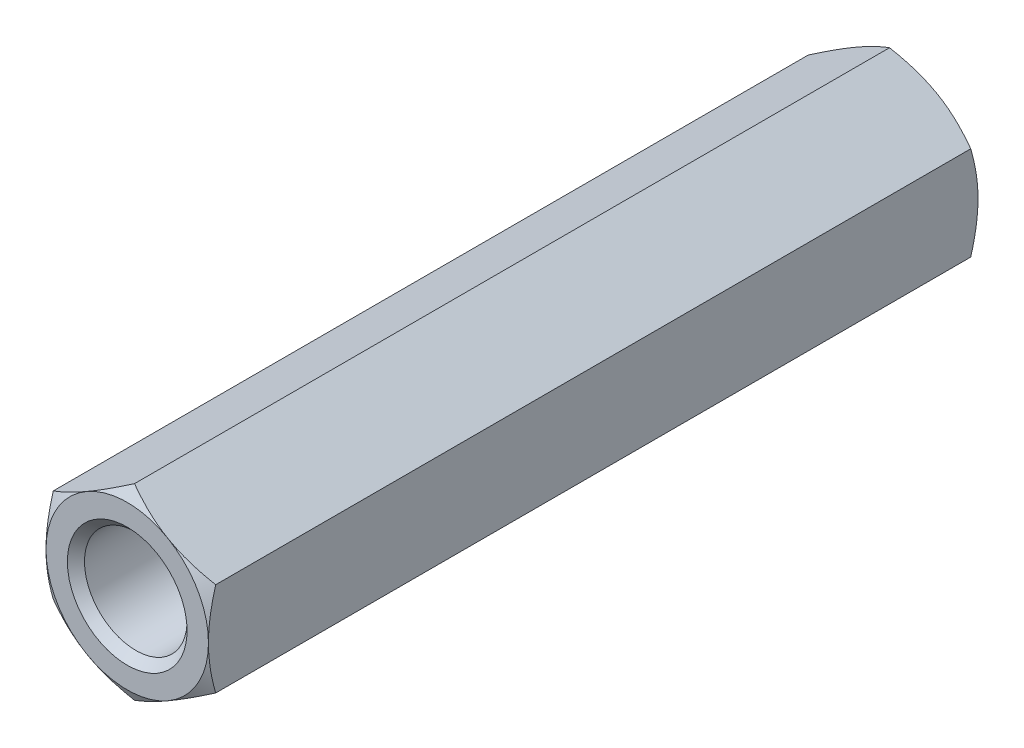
ISO-10303-21;
HEADER;
FILE_DESCRIPTION(('STEP AP214'),'2;1');
FILE_NAME('part.step','',(''),(''),'','','');
FILE_SCHEMA(('AUTOMOTIVE_DESIGN { 1 0 10303 214 1 1 1 1 }'));
ENDSEC;
DATA;
#1=APPLICATION_CONTEXT('core data for automotive mechanical design processes');
#2=APPLICATION_PROTOCOL_DEFINITION('international standard','automotive_design',2000,#1);
#3=PRODUCT_CONTEXT('',#1,'mechanical');
#4=PRODUCT('Part','Part','',(#3));
#5=PRODUCT_RELATED_PRODUCT_CATEGORY('part','',(#4));
#6=PRODUCT_DEFINITION_FORMATION('','',#4);
#7=PRODUCT_DEFINITION_CONTEXT('part definition',#1,'design');
#8=PRODUCT_DEFINITION('design','',#6,#7);
#9=PRODUCT_DEFINITION_SHAPE('','',#8);
#10=(LENGTH_UNIT() NAMED_UNIT(*) SI_UNIT(.MILLI.,.METRE.));
#11=(NAMED_UNIT(*) PLANE_ANGLE_UNIT() SI_UNIT($,.RADIAN.));
#12=(NAMED_UNIT(*) SI_UNIT($,.STERADIAN.) SOLID_ANGLE_UNIT());
#13=UNCERTAINTY_MEASURE_WITH_UNIT(LENGTH_MEASURE(1.E-05),#10,'distance_accuracy_value','');
#14=(GEOMETRIC_REPRESENTATION_CONTEXT(3) GLOBAL_UNCERTAINTY_ASSIGNED_CONTEXT((#13)) GLOBAL_UNIT_ASSIGNED_CONTEXT((#10,
#11,#12)) REPRESENTATION_CONTEXT('',''));
#15=CARTESIAN_POINT('',(0.,0.,0.));
#16=DIRECTION('',(0.,0.,1.));
#17=DIRECTION('',(1.,0.,0.));
#18=AXIS2_PLACEMENT_3D('',#15,#16,#17);
#19=CARTESIAN_POINT('',(9.5,5.48482755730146,90.));
#20=DIRECTION('',(-0.5,-0.866025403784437,0.));
#21=DIRECTION('',(-0.866025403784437,0.5,0.));
#22=AXIS2_PLACEMENT_3D('',#19,#20,#21);
#23=PLANE('',#22);
#24=CARTESIAN_POINT('',(-0.000200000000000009,10.9697705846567,0.848572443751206));
#25=CARTESIAN_POINT('',(0.208630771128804,10.8492020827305,0.778973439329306));
#26=CARTESIAN_POINT('',(0.418240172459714,10.7281840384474,0.712533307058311));
#27=CARTESIAN_POINT('',(0.839139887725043,10.4851774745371,0.586847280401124));
#28=CARTESIAN_POINT('',(1.05043073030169,10.3631886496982,0.52760375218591));
#29=CARTESIAN_POINT('',(1.68770779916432,9.99525656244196,0.361814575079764));
#30=CARTESIAN_POINT('',(2.11620976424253,9.74786083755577,0.267514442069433));
#31=CARTESIAN_POINT('',(2.75744333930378,9.37764446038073,0.156938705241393));
#32=CARTESIAN_POINT('',(2.96825921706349,9.25592985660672,0.125439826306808));
#33=CARTESIAN_POINT('',(3.39086703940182,9.01193711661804,0.072618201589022));
#34=CARTESIAN_POINT('',(3.60265900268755,8.88965896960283,0.0512956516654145));
#35=CARTESIAN_POINT('',(4.0265962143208,8.64489870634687,0.0193730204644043));
#36=CARTESIAN_POINT('',(4.23874074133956,8.52241700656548,0.00876019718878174));
#37=CARTESIAN_POINT('',(4.66322575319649,8.27734047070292,-0.00151746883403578));
#38=CARTESIAN_POINT('',(4.87556623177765,8.15474563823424,-0.00118264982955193));
#39=CARTESIAN_POINT('',(5.27254199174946,7.92555157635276,0.00967336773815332));
#40=CARTESIAN_POINT('',(5.45720529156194,7.81893617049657,0.018870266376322));
#41=CARTESIAN_POINT('',(5.82610000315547,7.60595470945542,0.045365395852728));
#42=CARTESIAN_POINT('',(6.01033138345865,7.4995886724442,0.0626641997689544));
#43=CARTESIAN_POINT('',(6.56231167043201,7.18090270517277,0.126304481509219));
#44=CARTESIAN_POINT('',(6.92908353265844,6.96914687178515,0.184381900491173));
#45=CARTESIAN_POINT('',(7.66651782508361,6.54338898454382,0.329576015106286));
#46=CARTESIAN_POINT('',(8.03708614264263,6.32944126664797,0.417308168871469));
#47=CARTESIAN_POINT('',(8.77269671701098,5.90473630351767,0.616423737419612));
#48=CARTESIAN_POINT('',(9.137748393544,5.6939736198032,0.727760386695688));
#49=CARTESIAN_POINT('',(9.5002,5.48471208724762,0.848572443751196));
#50=B_SPLINE_CURVE_WITH_KNOTS('',3,(#24,#25,#26,#27,#28,#29,#30,#31,#32,#33,#34,#35,#36,#37,#38,
#39,#40,#41,#42,#43,#44,#45,#46,#47,#48,#49),.UNSPECIFIED.,.F.,.F.,(4,2,2,2,2,2,2,2,2,2,2,2,4),
(0.,0.752880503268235,1.50600787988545,3.0154687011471,3.75167336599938,4.48789219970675,
5.22323407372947,5.95855322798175,6.59868084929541,7.23885375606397,8.52010929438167,
9.82978009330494,11.1368800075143),.UNSPECIFIED.);
#51=CARTESIAN_POINT('',(0.,10.9696551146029,0.848505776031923));
#52=VERTEX_POINT('',#51);
#53=CARTESIAN_POINT('',(4.75,8.22724133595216,0.));
#54=VERTEX_POINT('',#53);
#55=EDGE_CURVE('E330',#52,#54,#50,.T.);
#56=ORIENTED_EDGE('',*,*,#55,.F.);
#57=DIRECTION('',(0.,0.,-1.));
#58=VECTOR('',#57,1.);
#59=CARTESIAN_POINT('',(0.,10.9696551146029,90.));
#60=LINE('',#59,#58);
#61=CARTESIAN_POINT('',(0.,10.9696551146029,89.1514942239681));
#62=VERTEX_POINT('',#61);
#63=EDGE_CURVE('E239',#62,#52,#60,.T.);
#64=ORIENTED_EDGE('',*,*,#63,.F.);
#65=CARTESIAN_POINT('',(9.5002,5.48471208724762,89.1514275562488));
#66=CARTESIAN_POINT('',(9.29136922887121,5.60528058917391,89.2210265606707));
#67=CARTESIAN_POINT('',(9.0817598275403,5.72629863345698,89.2874666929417));
#68=CARTESIAN_POINT('',(8.66086011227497,5.96930519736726,89.4131527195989));
#69=CARTESIAN_POINT('',(8.44956926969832,6.09129402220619,89.4723962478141));
#70=CARTESIAN_POINT('',(7.81229220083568,6.45922610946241,89.6381854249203));
#71=CARTESIAN_POINT('',(7.38379023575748,6.7066218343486,89.7324855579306));
#72=CARTESIAN_POINT('',(6.74255666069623,7.07683821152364,89.8430612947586));
#73=CARTESIAN_POINT('',(6.53174078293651,7.19855281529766,89.8745601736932));
#74=CARTESIAN_POINT('',(6.10913296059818,7.44254555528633,89.927381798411));
#75=CARTESIAN_POINT('',(5.89734099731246,7.56482370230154,89.9487043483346));
#76=CARTESIAN_POINT('',(5.47340378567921,7.8095839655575,89.9806269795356));
#77=CARTESIAN_POINT('',(5.26125925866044,7.93206566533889,89.9912398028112));
#78=CARTESIAN_POINT('',(4.83677424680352,8.17714220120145,90.0015174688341));
#79=CARTESIAN_POINT('',(4.62443376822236,8.29973703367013,90.0011826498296));
#80=CARTESIAN_POINT('',(4.22745800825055,8.52893109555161,89.9903266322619));
#81=CARTESIAN_POINT('',(4.04279470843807,8.6355465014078,89.9811297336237));
#82=CARTESIAN_POINT('',(3.67389999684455,8.84852796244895,89.9546346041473));
#83=CARTESIAN_POINT('',(3.48966861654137,8.95489399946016,89.9373358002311));
#84=CARTESIAN_POINT('',(2.93768832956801,9.2735799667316,89.8736955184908));
#85=CARTESIAN_POINT('',(2.57091646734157,9.48533580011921,89.8156180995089));
#86=CARTESIAN_POINT('',(1.83348217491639,9.91109368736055,89.6704239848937));
#87=CARTESIAN_POINT('',(1.46291385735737,10.1250414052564,89.5826918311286));
#88=CARTESIAN_POINT('',(0.727303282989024,10.5497463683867,89.3835762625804));
#89=CARTESIAN_POINT('',(0.362251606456,10.7605090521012,89.2722396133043));
#90=CARTESIAN_POINT('',(-0.000199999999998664,10.9697705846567,89.1514275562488));
#91=B_SPLINE_CURVE_WITH_KNOTS('',3,(#65,#66,#67,#68,#69,#70,#71,#72,#73,#74,#75,#76,#77,#78,#79,
#80,#81,#82,#83,#84,#85,#86,#87,#88,#89,#90),.UNSPECIFIED.,.F.,.F.,(4,2,2,2,2,2,2,2,2,2,2,2,4),
(0.,0.752880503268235,1.50600787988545,3.01546870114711,3.75167336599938,4.48789219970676,
5.22323407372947,5.95855322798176,6.59868084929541,7.23885375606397,8.52010929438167,
9.82978009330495,11.1368800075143),.UNSPECIFIED.);
#92=CARTESIAN_POINT('',(4.75,8.22724133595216,90.));
#93=VERTEX_POINT('',#92);
#94=EDGE_CURVE('E225',#93,#62,#91,.T.);
#95=ORIENTED_EDGE('',*,*,#94,.F.);
#96=CARTESIAN_POINT('',(9.5,5.48482755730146,89.1514942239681));
#97=VERTEX_POINT('',#96);
#98=EDGE_CURVE('E301',#97,#93,#91,.T.);
#99=ORIENTED_EDGE('',*,*,#98,.F.);
#100=DIRECTION('',(0.,0.,-1.));
#101=VECTOR('',#100,1.);
#102=CARTESIAN_POINT('',(9.5,5.48482755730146,90.));
#103=LINE('',#102,#101);
#104=CARTESIAN_POINT('',(9.5,5.48482755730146,0.848505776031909));
#105=VERTEX_POINT('',#104);
#106=EDGE_CURVE('E227',#97,#105,#103,.T.);
#107=ORIENTED_EDGE('',*,*,#106,.T.);
#108=EDGE_CURVE('E37',#54,#105,#50,.T.);
#109=ORIENTED_EDGE('',*,*,#108,.F.);
#110=EDGE_LOOP('',(#56,#64,#95,#99,#107,#109));
#111=FACE_BOUND('',#110,.T.);
#112=ADVANCED_FACE('F14',(#111),#23,.F.);
#113=CARTESIAN_POINT('',(-9.5,5.48482755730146,90.));
#114=DIRECTION('',(-0.5,0.866025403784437,0.));
#115=DIRECTION('',(0.866025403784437,0.5,0.));
#116=AXIS2_PLACEMENT_3D('',#113,#114,#115);
#117=PLANE('',#116);
#118=ORIENTED_EDGE('',*,*,#63,.T.);
#119=CARTESIAN_POINT('',(0.000199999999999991,10.9697705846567,0.848572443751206));
#120=CARTESIAN_POINT('',(-0.208630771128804,10.8492020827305,0.778973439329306));
#121=CARTESIAN_POINT('',(-0.418240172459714,10.7281840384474,0.712533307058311));
#122=CARTESIAN_POINT('',(-0.839139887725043,10.4851774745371,0.586847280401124));
#123=CARTESIAN_POINT('',(-1.05043073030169,10.3631886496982,0.52760375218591));
#124=CARTESIAN_POINT('',(-1.68770779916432,9.99525656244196,0.361814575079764));
#125=CARTESIAN_POINT('',(-2.11620976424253,9.74786083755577,0.267514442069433));
#126=CARTESIAN_POINT('',(-2.75744333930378,9.37764446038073,0.156938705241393));
#127=CARTESIAN_POINT('',(-2.96825921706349,9.25592985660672,0.125439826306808));
#128=CARTESIAN_POINT('',(-3.39086703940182,9.01193711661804,0.072618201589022));
#129=CARTESIAN_POINT('',(-3.60265900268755,8.88965896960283,0.0512956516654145));
#130=CARTESIAN_POINT('',(-4.0265962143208,8.64489870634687,0.0193730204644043));
#131=CARTESIAN_POINT('',(-4.23874074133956,8.52241700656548,0.00876019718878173));
#132=CARTESIAN_POINT('',(-4.66322575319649,8.27734047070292,-0.00151746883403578));
#133=CARTESIAN_POINT('',(-4.87556623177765,8.15474563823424,-0.00118264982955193));
#134=CARTESIAN_POINT('',(-5.27254199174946,7.92555157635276,0.00967336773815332));
#135=CARTESIAN_POINT('',(-5.45720529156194,7.81893617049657,0.018870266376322));
#136=CARTESIAN_POINT('',(-5.82610000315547,7.60595470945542,0.045365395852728));
#137=CARTESIAN_POINT('',(-6.01033138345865,7.4995886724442,0.0626641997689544));
#138=CARTESIAN_POINT('',(-6.56231167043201,7.18090270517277,0.126304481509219));
#139=CARTESIAN_POINT('',(-6.92908353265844,6.96914687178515,0.184381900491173));
#140=CARTESIAN_POINT('',(-7.66651782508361,6.54338898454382,0.329576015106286));
#141=CARTESIAN_POINT('',(-8.03708614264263,6.32944126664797,0.417308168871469));
#142=CARTESIAN_POINT('',(-8.77269671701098,5.90473630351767,0.616423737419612));
#143=CARTESIAN_POINT('',(-9.137748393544,5.6939736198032,0.727760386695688));
#144=CARTESIAN_POINT('',(-9.5002,5.48471208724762,0.848572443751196));
#145=B_SPLINE_CURVE_WITH_KNOTS('',3,(#119,#120,#121,#122,#123,#124,#125,#126,#127,#128,#129,
#130,#131,#132,#133,#134,#135,#136,#137,#138,#139,#140,#141,#142,#143,#144),.UNSPECIFIED.,.F.,
.F.,(4,2,2,2,2,2,2,2,2,2,2,2,4),(0.,0.752880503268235,1.50600787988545,3.0154687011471,
3.75167336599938,4.48789219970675,5.22323407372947,5.95855322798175,6.59868084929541,
7.23885375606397,8.52010929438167,9.82978009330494,11.1368800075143),.UNSPECIFIED.);
#146=CARTESIAN_POINT('',(-4.75,8.22724133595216,0.));
#147=VERTEX_POINT('',#146);
#148=EDGE_CURVE('E184',#52,#147,#145,.T.);
#149=ORIENTED_EDGE('',*,*,#148,.T.);
#150=CARTESIAN_POINT('',(-9.5,5.48482755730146,0.848505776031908));
#151=VERTEX_POINT('',#150);
#152=EDGE_CURVE('E319',#147,#151,#145,.T.);
#153=ORIENTED_EDGE('',*,*,#152,.T.);
#154=DIRECTION('',(0.,0.,-1.));
#155=VECTOR('',#154,1.);
#156=CARTESIAN_POINT('',(-9.5,5.48482755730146,90.));
#157=LINE('',#156,#155);
#158=CARTESIAN_POINT('',(-9.5,5.48482755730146,89.1514942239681));
#159=VERTEX_POINT('',#158);
#160=EDGE_CURVE('E236',#159,#151,#157,.T.);
#161=ORIENTED_EDGE('',*,*,#160,.F.);
#162=CARTESIAN_POINT('',(-9.5002,5.48471208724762,89.1514275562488));
#163=CARTESIAN_POINT('',(-9.29136922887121,5.60528058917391,89.2210265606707));
#164=CARTESIAN_POINT('',(-9.0817598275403,5.72629863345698,89.2874666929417));
#165=CARTESIAN_POINT('',(-8.66086011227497,5.96930519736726,89.4131527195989));
#166=CARTESIAN_POINT('',(-8.44956926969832,6.09129402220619,89.4723962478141));
#167=CARTESIAN_POINT('',(-7.81229220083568,6.45922610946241,89.6381854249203));
#168=CARTESIAN_POINT('',(-7.38379023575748,6.7066218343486,89.7324855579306));
#169=CARTESIAN_POINT('',(-6.74255666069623,7.07683821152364,89.8430612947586));
#170=CARTESIAN_POINT('',(-6.53174078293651,7.19855281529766,89.8745601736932));
#171=CARTESIAN_POINT('',(-6.10913296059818,7.44254555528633,89.927381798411));
#172=CARTESIAN_POINT('',(-5.89734099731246,7.56482370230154,89.9487043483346));
#173=CARTESIAN_POINT('',(-5.47340378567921,7.8095839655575,89.9806269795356));
#174=CARTESIAN_POINT('',(-5.26125925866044,7.93206566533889,89.9912398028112));
#175=CARTESIAN_POINT('',(-4.83677424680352,8.17714220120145,90.0015174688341));
#176=CARTESIAN_POINT('',(-4.62443376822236,8.29973703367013,90.0011826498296));
#177=CARTESIAN_POINT('',(-4.22745800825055,8.52893109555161,89.9903266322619));
#178=CARTESIAN_POINT('',(-4.04279470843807,8.6355465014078,89.9811297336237));
#179=CARTESIAN_POINT('',(-3.67389999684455,8.84852796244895,89.9546346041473));
#180=CARTESIAN_POINT('',(-3.48966861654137,8.95489399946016,89.9373358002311));
#181=CARTESIAN_POINT('',(-2.93768832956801,9.2735799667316,89.8736955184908));
#182=CARTESIAN_POINT('',(-2.57091646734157,9.48533580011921,89.8156180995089));
#183=CARTESIAN_POINT('',(-1.83348217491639,9.91109368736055,89.6704239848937));
#184=CARTESIAN_POINT('',(-1.46291385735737,10.1250414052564,89.5826918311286));
#185=CARTESIAN_POINT('',(-0.727303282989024,10.5497463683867,89.3835762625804));
#186=CARTESIAN_POINT('',(-0.362251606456,10.7605090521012,89.2722396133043));
#187=CARTESIAN_POINT('',(0.000199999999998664,10.9697705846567,89.1514275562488));
#188=B_SPLINE_CURVE_WITH_KNOTS('',3,(#162,#163,#164,#165,#166,#167,#168,#169,#170,#171,#172,
#173,#174,#175,#176,#177,#178,#179,#180,#181,#182,#183,#184,#185,#186,#187),.UNSPECIFIED.,.F.,
.F.,(4,2,2,2,2,2,2,2,2,2,2,2,4),(0.,0.752880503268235,1.50600787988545,3.01546870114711,
3.75167336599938,4.48789219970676,5.22323407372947,5.95855322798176,6.59868084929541,
7.23885375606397,8.52010929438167,9.82978009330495,11.1368800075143),.UNSPECIFIED.);
#189=CARTESIAN_POINT('',(-4.75,8.22724133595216,90.));
#190=VERTEX_POINT('',#189);
#191=EDGE_CURVE('E218',#159,#190,#188,.T.);
#192=ORIENTED_EDGE('',*,*,#191,.T.);
#193=EDGE_CURVE('E226',#190,#62,#188,.T.);
#194=ORIENTED_EDGE('',*,*,#193,.T.);
#195=EDGE_LOOP('',(#118,#149,#153,#161,#192,#194));
#196=FACE_BOUND('',#195,.T.);
#197=ADVANCED_FACE('F197',(#196),#117,.T.);
#198=CARTESIAN_POINT('',(-9.5,5.48482755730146,90.));
#199=DIRECTION('',(1.,0.,0.));
#200=DIRECTION('',(0.,0.,-1.));
#201=AXIS2_PLACEMENT_3D('',#198,#199,#200);
#202=PLANE('',#201);
#203=CARTESIAN_POINT('',(-9.5,-14.7672659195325,4.65292601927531));
#204=CARTESIAN_POINT('',(-9.5,-14.5596695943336,4.55212888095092));
#205=CARTESIAN_POINT('',(-9.5,-14.351830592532,4.45183177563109));
#206=CARTESIAN_POINT('',(-9.5,-13.9356166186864,4.25235081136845));
#207=CARTESIAN_POINT('',(-9.5,-13.7272416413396,4.15316696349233));
#208=CARTESIAN_POINT('',(-9.5,-13.1011817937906,3.85742915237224));
#209=CARTESIAN_POINT('',(-9.5,-12.6826228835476,3.66271856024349));
#210=CARTESIAN_POINT('',(-9.5,-11.8404540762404,3.27834286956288));
#211=CARTESIAN_POINT('',(-9.5,-11.4168291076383,3.08871071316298));
#212=CARTESIAN_POINT('',(-9.5,-10.5662226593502,2.71715766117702));
#213=CARTESIAN_POINT('',(-9.5,-10.1392413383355,2.53523640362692));
#214=CARTESIAN_POINT('',(-9.5,-9.2673080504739,2.1753939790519));
#215=CARTESIAN_POINT('',(-9.5,-8.82222265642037,1.99779435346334));
#216=CARTESIAN_POINT('',(-9.5,-7.92685843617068,1.65595320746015));
#217=CARTESIAN_POINT('',(-9.5,-7.47657903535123,1.49171318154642));
#218=CARTESIAN_POINT('',(-9.5,-6.57093674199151,1.18087857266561));
#219=CARTESIAN_POINT('',(-9.5,-6.11558614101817,1.03424856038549));
#220=CARTESIAN_POINT('',(-9.5,-5.19836923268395,0.763314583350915));
#221=CARTESIAN_POINT('',(-9.5,-4.7365050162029,0.639003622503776));
#222=CARTESIAN_POINT('',(-9.5,-3.80850349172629,0.419324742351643));
#223=CARTESIAN_POINT('',(-9.5,-3.34240483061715,0.323797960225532));
#224=CARTESIAN_POINT('',(-9.5,-2.63898486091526,0.206211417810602));
#225=CARTESIAN_POINT('',(-9.5,-2.4037824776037,0.171298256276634));
#226=CARTESIAN_POINT('',(-9.5,-1.93219697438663,0.110723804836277));
#227=CARTESIAN_POINT('',(-9.5,-1.69581397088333,0.0850616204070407));
#228=CARTESIAN_POINT('',(-9.5,-1.22528668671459,0.0438240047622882));
#229=CARTESIAN_POINT('',(-9.5,-0.991153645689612,0.0281208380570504));
#230=CARTESIAN_POINT('',(-9.5,-0.522433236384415,0.00663142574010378));
#231=CARTESIAN_POINT('',(-9.5,-0.287845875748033,0.000845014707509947));
#232=CARTESIAN_POINT('',(-9.5,0.181363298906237,-0.000672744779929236));
#233=CARTESIAN_POINT('',(-9.5,0.415985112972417,0.0035959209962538));
#234=CARTESIAN_POINT('',(-9.5,0.884839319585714,0.0220834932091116));
#235=CARTESIAN_POINT('',(-9.5,1.11907169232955,0.0363028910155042));
#236=CARTESIAN_POINT('',(-9.5,1.68097627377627,0.0820480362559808));
#237=CARTESIAN_POINT('',(-9.5,2.00827686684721,0.118238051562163));
#238=CARTESIAN_POINT('',(-9.5,2.66045587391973,0.208080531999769));
#239=CARTESIAN_POINT('',(-9.5,2.98533395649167,0.261735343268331));
#240=CARTESIAN_POINT('',(-9.5,3.95596021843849,0.446052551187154));
#241=CARTESIAN_POINT('',(-9.5,4.59733913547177,0.600034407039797));
#242=CARTESIAN_POINT('',(-9.5,5.5563862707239,0.867143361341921));
#243=CARTESIAN_POINT('',(-9.5,5.87902704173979,0.963444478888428));
#244=CARTESIAN_POINT('',(-9.5,6.52117531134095,1.16607364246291));
#245=CARTESIAN_POINT('',(-9.5,6.84068278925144,1.27240175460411));
#246=CARTESIAN_POINT('',(-9.5,7.47666412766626,1.49337690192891));
#247=CARTESIAN_POINT('',(-9.5,7.79313894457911,1.60802120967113));
#248=CARTESIAN_POINT('',(-9.5,8.42346519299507,1.84427742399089));
#249=CARTESIAN_POINT('',(-9.5,8.73731665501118,1.96588924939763));
#250=CARTESIAN_POINT('',(-9.5,9.47687197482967,2.26039544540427));
#251=CARTESIAN_POINT('',(-9.5,9.90157382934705,2.43580132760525));
#252=CARTESIAN_POINT('',(-9.5,10.7473629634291,2.79514633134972));
#253=CARTESIAN_POINT('',(-9.5,11.1684500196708,2.97908597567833));
#254=CARTESIAN_POINT('',(-9.5,12.0076809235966,3.35379288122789));
#255=CARTESIAN_POINT('',(-9.5,12.4258240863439,3.5445616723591));
#256=CARTESIAN_POINT('',(-9.5,13.2595626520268,3.93155139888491));
#257=CARTESIAN_POINT('',(-9.5,13.6751581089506,4.12777221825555));
#258=CARTESIAN_POINT('',(-9.5,14.5046789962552,4.52486627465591));
#259=CARTESIAN_POINT('',(-9.5,14.9186020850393,4.72574439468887));
#260=CARTESIAN_POINT('',(-9.5,15.7446570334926,5.13114973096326));
#261=CARTESIAN_POINT('',(-9.5,16.1567888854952,5.33567696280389));
#262=CARTESIAN_POINT('',(-9.5,16.979482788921,5.7477289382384));
#263=CARTESIAN_POINT('',(-9.5,17.3900450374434,5.95525328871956));
#264=CARTESIAN_POINT('',(-9.5,18.2098797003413,6.37283570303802));
#265=CARTESIAN_POINT('',(-9.5,18.6191521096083,6.58289377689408));
#266=CARTESIAN_POINT('',(-9.5,19.7767832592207,7.18085913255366));
#267=CARTESIAN_POINT('',(-9.5,20.5238458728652,7.57127560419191));
#268=CARTESIAN_POINT('',(-9.5,22.0151817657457,8.35745134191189));
#269=CARTESIAN_POINT('',(-9.5,22.7594549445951,8.75321079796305));
#270=CARTESIAN_POINT('',(-9.5,24.2439478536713,9.54782405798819));
#271=CARTESIAN_POINT('',(-9.5,24.98417306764,9.94666762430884));
#272=CARTESIAN_POINT('',(-9.5,26.0931945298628,10.5473118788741));
#273=CARTESIAN_POINT('',(-9.5,26.4626389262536,10.7479176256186));
#274=CARTESIAN_POINT('',(-9.5,27.2011385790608,11.1498428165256));
#275=CARTESIAN_POINT('',(-9.5,27.5701938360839,11.351162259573));
#276=CARTESIAN_POINT('',(-9.5,27.9390765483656,11.5527974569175));
#277=B_SPLINE_CURVE_WITH_KNOTS('',3,(#203,#204,#205,#206,#207,#208,#209,#210,#211,#212,#213,
#214,#215,#216,#217,#218,#219,#220,#221,#222,#223,#224,#225,#226,#227,#228,#229,#230,#231,#232,
#233,#234,#235,#236,#237,#238,#239,#240,#241,#242,#243,#244,#245,#246,#247,#248,#249,#250,#251,
#252,#253,#254,#255,#256,#257,#258,#259,#260,#261,#262,#263,#264,#265,#266,#267,#268,#269,#270,
#271,#272,#273,#274,#275,#276),.UNSPECIFIED.,.F.,.F.,(4,2,2,2,2,2,2,2,2,2,2,2,2,2,2,2,2,2,2,2,2,
2,2,2,2,2,2,2,2,2,2,2,2,2,2,2,4),(0.,0.692318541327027,1.38464395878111,2.76949790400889,
4.16183368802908,5.55410404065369,6.99156897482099,8.42919449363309,9.86387742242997,
11.2981098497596,12.7242751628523,13.4374603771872,14.1505766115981,14.8543508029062,
15.5581132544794,16.2618767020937,16.9656749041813,17.9530035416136,18.9404648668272,
20.9164710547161,21.9265044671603,22.9365445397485,23.9462548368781,24.9559533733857,
26.3343232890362,27.7127777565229,29.0915429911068,30.4702789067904,31.8505323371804,
33.2307916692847,34.6108715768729,35.9909569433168,38.5197081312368,41.0485494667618,
43.5710546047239,44.8322385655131,46.0934205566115),.UNSPECIFIED.);
#278=CARTESIAN_POINT('',(-9.5,-5.48482755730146,0.848505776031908));
#279=VERTEX_POINT('',#278);
#280=CARTESIAN_POINT('',(-9.5,0.,0.));
#281=VERTEX_POINT('',#280);
#282=EDGE_CURVE('E178',#279,#281,#277,.T.);
#283=ORIENTED_EDGE('',*,*,#282,.F.);
#284=DIRECTION('',(0.,0.,-1.));
#285=VECTOR('',#284,1.);
#286=CARTESIAN_POINT('',(-9.5,-5.48482755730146,90.));
#287=LINE('',#286,#285);
#288=CARTESIAN_POINT('',(-9.5,-5.48482755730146,89.1514942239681));
#289=VERTEX_POINT('',#288);
#290=EDGE_CURVE('E233',#289,#279,#287,.T.);
#291=ORIENTED_EDGE('',*,*,#290,.F.);
#292=CARTESIAN_POINT('',(-9.5,-14.7672659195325,85.3470739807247));
#293=CARTESIAN_POINT('',(-9.5,-14.5596695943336,85.4478711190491));
#294=CARTESIAN_POINT('',(-9.5,-14.351830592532,85.5481682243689));
#295=CARTESIAN_POINT('',(-9.5,-13.9356166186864,85.7476491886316));
#296=CARTESIAN_POINT('',(-9.5,-13.7272416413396,85.8468330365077));
#297=CARTESIAN_POINT('',(-9.5,-13.1011817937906,86.1425708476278));
#298=CARTESIAN_POINT('',(-9.5,-12.6826228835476,86.3372814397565));
#299=CARTESIAN_POINT('',(-9.5,-11.8404540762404,86.7216571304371));
#300=CARTESIAN_POINT('',(-9.5,-11.4168291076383,86.9112892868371));
#301=CARTESIAN_POINT('',(-9.5,-10.5662226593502,87.282842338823));
#302=CARTESIAN_POINT('',(-9.5,-10.1392413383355,87.4647635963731));
#303=CARTESIAN_POINT('',(-9.5,-9.2673080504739,87.8246060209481));
#304=CARTESIAN_POINT('',(-9.5,-8.82222265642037,88.0022056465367));
#305=CARTESIAN_POINT('',(-9.5,-7.92685843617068,88.3440467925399));
#306=CARTESIAN_POINT('',(-9.5,-7.47657903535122,88.5082868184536));
#307=CARTESIAN_POINT('',(-9.5,-6.5709367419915,88.8191214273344));
#308=CARTESIAN_POINT('',(-9.5,-6.11558614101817,88.9657514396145));
#309=CARTESIAN_POINT('',(-9.5,-5.19836923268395,89.2366854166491));
#310=CARTESIAN_POINT('',(-9.5,-4.7365050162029,89.3609963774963));
#311=CARTESIAN_POINT('',(-9.5,-3.8085034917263,89.5806752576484));
#312=CARTESIAN_POINT('',(-9.5,-3.34240483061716,89.6762020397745));
#313=CARTESIAN_POINT('',(-9.5,-2.63898486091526,89.7937885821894));
#314=CARTESIAN_POINT('',(-9.5,-2.40378247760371,89.8287017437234));
#315=CARTESIAN_POINT('',(-9.5,-1.93219697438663,89.8892761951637));
#316=CARTESIAN_POINT('',(-9.5,-1.69581397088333,89.914938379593));
#317=CARTESIAN_POINT('',(-9.5,-1.22528668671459,89.9561759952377));
#318=CARTESIAN_POINT('',(-9.5,-0.991153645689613,89.971879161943));
#319=CARTESIAN_POINT('',(-9.5,-0.522433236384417,89.9933685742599));
#320=CARTESIAN_POINT('',(-9.5,-0.287845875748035,89.9991549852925));
#321=CARTESIAN_POINT('',(-9.5,0.181363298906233,90.00067274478));
#322=CARTESIAN_POINT('',(-9.5,0.415985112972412,89.9964040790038));
#323=CARTESIAN_POINT('',(-9.5,0.884839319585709,89.9779165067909));
#324=CARTESIAN_POINT('',(-9.5,1.11907169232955,89.9636971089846));
#325=CARTESIAN_POINT('',(-9.5,1.68097627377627,89.9179519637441));
#326=CARTESIAN_POINT('',(-9.5,2.0082768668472,89.8817619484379));
#327=CARTESIAN_POINT('',(-9.5,2.66045587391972,89.7919194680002));
#328=CARTESIAN_POINT('',(-9.5,2.98533395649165,89.7382646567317));
#329=CARTESIAN_POINT('',(-9.5,3.95596021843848,89.5539474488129));
#330=CARTESIAN_POINT('',(-9.5,4.59733913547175,89.3999655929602));
#331=CARTESIAN_POINT('',(-9.5,5.55638627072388,89.1328566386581));
#332=CARTESIAN_POINT('',(-9.5,5.87902704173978,89.0365555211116));
#333=CARTESIAN_POINT('',(-9.5,6.52117531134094,88.8339263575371));
#334=CARTESIAN_POINT('',(-9.5,6.84068278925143,88.7275982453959));
#335=CARTESIAN_POINT('',(-9.5,7.47666412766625,88.5066230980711));
#336=CARTESIAN_POINT('',(-9.5,7.7931389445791,88.3919787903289));
#337=CARTESIAN_POINT('',(-9.5,8.42346519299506,88.1557225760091));
#338=CARTESIAN_POINT('',(-9.5,8.73731665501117,88.0341107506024));
#339=CARTESIAN_POINT('',(-9.5,9.47687197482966,87.7396045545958));
#340=CARTESIAN_POINT('',(-9.5,9.90157382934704,87.5641986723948));
#341=CARTESIAN_POINT('',(-9.5,10.7473629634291,87.2048536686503));
#342=CARTESIAN_POINT('',(-9.5,11.1684500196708,87.0209140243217));
#343=CARTESIAN_POINT('',(-9.5,12.0076809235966,86.6462071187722));
#344=CARTESIAN_POINT('',(-9.5,12.4258240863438,86.4554383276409));
#345=CARTESIAN_POINT('',(-9.5,13.2595626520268,86.0684486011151));
#346=CARTESIAN_POINT('',(-9.5,13.6751581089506,85.8722277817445));
#347=CARTESIAN_POINT('',(-9.5,14.5046789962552,85.4751337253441));
#348=CARTESIAN_POINT('',(-9.5,14.9186020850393,85.2742556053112));
#349=CARTESIAN_POINT('',(-9.5,15.7446570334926,84.8688502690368));
#350=CARTESIAN_POINT('',(-9.5,16.1567888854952,84.6643230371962));
#351=CARTESIAN_POINT('',(-9.5,16.979482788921,84.2522710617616));
#352=CARTESIAN_POINT('',(-9.5,17.3900450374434,84.0447467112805));
#353=CARTESIAN_POINT('',(-9.5,18.2098797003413,83.627164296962));
#354=CARTESIAN_POINT('',(-9.5,18.6191521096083,83.417106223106));
#355=CARTESIAN_POINT('',(-9.5,19.7767832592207,82.8191408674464));
#356=CARTESIAN_POINT('',(-9.5,20.5238458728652,82.4287243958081));
#357=CARTESIAN_POINT('',(-9.5,22.0151817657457,81.6425486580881));
#358=CARTESIAN_POINT('',(-9.5,22.7594549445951,81.246789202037));
#359=CARTESIAN_POINT('',(-9.5,24.2439478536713,80.4521759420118));
#360=CARTESIAN_POINT('',(-9.5,24.98417306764,80.0533323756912));
#361=CARTESIAN_POINT('',(-9.5,26.0931945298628,79.4526881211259));
#362=CARTESIAN_POINT('',(-9.5,26.4626389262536,79.2520823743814));
#363=CARTESIAN_POINT('',(-9.5,27.2011385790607,78.8501571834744));
#364=CARTESIAN_POINT('',(-9.5,27.5701938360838,78.6488377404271));
#365=CARTESIAN_POINT('',(-9.5,27.9390765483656,78.4472025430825));
#366=B_SPLINE_CURVE_WITH_KNOTS('',3,(#292,#293,#294,#295,#296,#297,#298,#299,#300,#301,#302,
#303,#304,#305,#306,#307,#308,#309,#310,#311,#312,#313,#314,#315,#316,#317,#318,#319,#320,#321,
#322,#323,#324,#325,#326,#327,#328,#329,#330,#331,#332,#333,#334,#335,#336,#337,#338,#339,#340,
#341,#342,#343,#344,#345,#346,#347,#348,#349,#350,#351,#352,#353,#354,#355,#356,#357,#358,#359,
#360,#361,#362,#363,#364,#365),.UNSPECIFIED.,.F.,.F.,(4,2,2,2,2,2,2,2,2,2,2,2,2,2,2,2,2,2,2,2,2,
2,2,2,2,2,2,2,2,2,2,2,2,2,2,2,4),(0.,0.692318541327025,1.3846439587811,2.76949790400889,
4.16183368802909,5.5541040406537,6.991568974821,8.42919449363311,9.86387742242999,
11.2981098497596,12.7242751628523,13.4374603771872,14.1505766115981,14.8543508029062,
15.5581132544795,16.2618767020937,16.9656749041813,17.9530035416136,18.9404648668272,
20.9164710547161,21.9265044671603,22.9365445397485,23.9462548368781,24.9559533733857,
26.3343232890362,27.7127777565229,29.0915429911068,30.4702789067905,31.8505323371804,
33.2307916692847,34.6108715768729,35.9909569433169,38.5197081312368,41.0485494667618,
43.5710546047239,44.8322385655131,46.0934205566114),.UNSPECIFIED.);
#367=CARTESIAN_POINT('',(-9.5,0.,90.));
#368=VERTEX_POINT('',#367);
#369=EDGE_CURVE('E203',#368,#289,#366,.F.);
#370=ORIENTED_EDGE('',*,*,#369,.F.);
#371=EDGE_CURVE('E210',#159,#368,#366,.F.);
#372=ORIENTED_EDGE('',*,*,#371,.F.);
#373=ORIENTED_EDGE('',*,*,#160,.T.);
#374=EDGE_CURVE('E186',#281,#151,#277,.T.);
#375=ORIENTED_EDGE('',*,*,#374,.F.);
#376=EDGE_LOOP('',(#283,#291,#370,#372,#373,#375));
#377=FACE_BOUND('',#376,.T.);
#378=ADVANCED_FACE('F193',(#377),#202,.F.);
#379=CARTESIAN_POINT('',(-9.5,-5.48482755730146,90.));
#380=DIRECTION('',(0.5,0.866025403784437,0.));
#381=DIRECTION('',(0.866025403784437,-0.5,0.));
#382=AXIS2_PLACEMENT_3D('',#379,#380,#381);
#383=PLANE('',#382);
#384=CARTESIAN_POINT('',(0.000199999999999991,-10.9697705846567,0.848572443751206));
#385=CARTESIAN_POINT('',(-0.208630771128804,-10.8492020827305,0.778973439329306));
#386=CARTESIAN_POINT('',(-0.418240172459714,-10.7281840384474,0.712533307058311));
#387=CARTESIAN_POINT('',(-0.839139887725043,-10.4851774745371,0.586847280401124));
#388=CARTESIAN_POINT('',(-1.05043073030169,-10.3631886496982,0.52760375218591));
#389=CARTESIAN_POINT('',(-1.68770779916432,-9.99525656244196,0.361814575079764));
#390=CARTESIAN_POINT('',(-2.11620976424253,-9.74786083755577,0.267514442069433));
#391=CARTESIAN_POINT('',(-2.75744333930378,-9.37764446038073,0.156938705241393));
#392=CARTESIAN_POINT('',(-2.96825921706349,-9.25592985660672,0.125439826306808));
#393=CARTESIAN_POINT('',(-3.39086703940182,-9.01193711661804,0.072618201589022));
#394=CARTESIAN_POINT('',(-3.60265900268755,-8.88965896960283,0.0512956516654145));
#395=CARTESIAN_POINT('',(-4.0265962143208,-8.64489870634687,0.0193730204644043));
#396=CARTESIAN_POINT('',(-4.23874074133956,-8.52241700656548,0.00876019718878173));
#397=CARTESIAN_POINT('',(-4.66322575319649,-8.27734047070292,-0.00151746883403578));
#398=CARTESIAN_POINT('',(-4.87556623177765,-8.15474563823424,-0.00118264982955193));
#399=CARTESIAN_POINT('',(-5.27254199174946,-7.92555157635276,0.00967336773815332));
#400=CARTESIAN_POINT('',(-5.45720529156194,-7.81893617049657,0.018870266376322));
#401=CARTESIAN_POINT('',(-5.82610000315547,-7.60595470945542,0.045365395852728));
#402=CARTESIAN_POINT('',(-6.01033138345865,-7.4995886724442,0.0626641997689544));
#403=CARTESIAN_POINT('',(-6.56231167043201,-7.18090270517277,0.126304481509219));
#404=CARTESIAN_POINT('',(-6.92908353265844,-6.96914687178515,0.184381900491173));
#405=CARTESIAN_POINT('',(-7.66651782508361,-6.54338898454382,0.329576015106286));
#406=CARTESIAN_POINT('',(-8.03708614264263,-6.32944126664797,0.417308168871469));
#407=CARTESIAN_POINT('',(-8.77269671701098,-5.90473630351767,0.616423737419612));
#408=CARTESIAN_POINT('',(-9.137748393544,-5.6939736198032,0.727760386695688));
#409=CARTESIAN_POINT('',(-9.5002,-5.48471208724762,0.848572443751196));
#410=B_SPLINE_CURVE_WITH_KNOTS('',3,(#384,#385,#386,#387,#388,#389,#390,#391,#392,#393,#394,
#395,#396,#397,#398,#399,#400,#401,#402,#403,#404,#405,#406,#407,#408,#409),.UNSPECIFIED.,.F.,
.F.,(4,2,2,2,2,2,2,2,2,2,2,2,4),(0.,0.752880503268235,1.50600787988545,3.0154687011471,
3.75167336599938,4.48789219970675,5.22323407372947,5.95855322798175,6.59868084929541,
7.23885375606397,8.52010929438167,9.82978009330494,11.1368800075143),.UNSPECIFIED.);
#411=CARTESIAN_POINT('',(0.,-10.9696551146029,0.848505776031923));
#412=VERTEX_POINT('',#411);
#413=CARTESIAN_POINT('',(-4.75,-8.22724133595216,0.));
#414=VERTEX_POINT('',#413);
#415=EDGE_CURVE('E166',#412,#414,#410,.T.);
#416=ORIENTED_EDGE('',*,*,#415,.F.);
#417=DIRECTION('',(0.,0.,-1.));
#418=VECTOR('',#417,1.);
#419=CARTESIAN_POINT('',(0.,-10.9696551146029,90.));
#420=LINE('',#419,#418);
#421=CARTESIAN_POINT('',(0.,-10.9696551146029,89.1514942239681));
#422=VERTEX_POINT('',#421);
#423=EDGE_CURVE('E230',#422,#412,#420,.T.);
#424=ORIENTED_EDGE('',*,*,#423,.F.);
#425=CARTESIAN_POINT('',(-9.5002,-5.48471208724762,89.1514275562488));
#426=CARTESIAN_POINT('',(-9.29136922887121,-5.60528058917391,89.2210265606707));
#427=CARTESIAN_POINT('',(-9.0817598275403,-5.72629863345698,89.2874666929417));
#428=CARTESIAN_POINT('',(-8.66086011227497,-5.96930519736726,89.4131527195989));
#429=CARTESIAN_POINT('',(-8.44956926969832,-6.09129402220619,89.4723962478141));
#430=CARTESIAN_POINT('',(-7.81229220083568,-6.45922610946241,89.6381854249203));
#431=CARTESIAN_POINT('',(-7.38379023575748,-6.7066218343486,89.7324855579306));
#432=CARTESIAN_POINT('',(-6.74255666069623,-7.07683821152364,89.8430612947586));
#433=CARTESIAN_POINT('',(-6.53174078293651,-7.19855281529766,89.8745601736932));
#434=CARTESIAN_POINT('',(-6.10913296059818,-7.44254555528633,89.927381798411));
#435=CARTESIAN_POINT('',(-5.89734099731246,-7.56482370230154,89.9487043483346));
#436=CARTESIAN_POINT('',(-5.47340378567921,-7.8095839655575,89.9806269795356));
#437=CARTESIAN_POINT('',(-5.26125925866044,-7.93206566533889,89.9912398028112));
#438=CARTESIAN_POINT('',(-4.83677424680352,-8.17714220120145,90.0015174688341));
#439=CARTESIAN_POINT('',(-4.62443376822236,-8.29973703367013,90.0011826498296));
#440=CARTESIAN_POINT('',(-4.22745800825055,-8.52893109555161,89.9903266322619));
#441=CARTESIAN_POINT('',(-4.04279470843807,-8.6355465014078,89.9811297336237));
#442=CARTESIAN_POINT('',(-3.67389999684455,-8.84852796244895,89.9546346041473));
#443=CARTESIAN_POINT('',(-3.48966861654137,-8.95489399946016,89.9373358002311));
#444=CARTESIAN_POINT('',(-2.93768832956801,-9.2735799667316,89.8736955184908));
#445=CARTESIAN_POINT('',(-2.57091646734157,-9.48533580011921,89.8156180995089));
#446=CARTESIAN_POINT('',(-1.83348217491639,-9.91109368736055,89.6704239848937));
#447=CARTESIAN_POINT('',(-1.46291385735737,-10.1250414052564,89.5826918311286));
#448=CARTESIAN_POINT('',(-0.727303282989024,-10.5497463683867,89.3835762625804));
#449=CARTESIAN_POINT('',(-0.362251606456,-10.7605090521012,89.2722396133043));
#450=CARTESIAN_POINT('',(0.000199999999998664,-10.9697705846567,89.1514275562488));
#451=B_SPLINE_CURVE_WITH_KNOTS('',3,(#425,#426,#427,#428,#429,#430,#431,#432,#433,#434,#435,
#436,#437,#438,#439,#440,#441,#442,#443,#444,#445,#446,#447,#448,#449,#450),.UNSPECIFIED.,.F.,
.F.,(4,2,2,2,2,2,2,2,2,2,2,2,4),(0.,0.752880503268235,1.50600787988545,3.01546870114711,
3.75167336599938,4.48789219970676,5.22323407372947,5.95855322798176,6.59868084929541,
7.23885375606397,8.52010929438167,9.82978009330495,11.1368800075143),.UNSPECIFIED.);
#452=CARTESIAN_POINT('',(-4.75,-8.22724133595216,90.));
#453=VERTEX_POINT('',#452);
#454=EDGE_CURVE('E212',#453,#422,#451,.T.);
#455=ORIENTED_EDGE('',*,*,#454,.F.);
#456=EDGE_CURVE('E211',#289,#453,#451,.T.);
#457=ORIENTED_EDGE('',*,*,#456,.F.);
#458=ORIENTED_EDGE('',*,*,#290,.T.);
#459=EDGE_CURVE('E185',#414,#279,#410,.T.);
#460=ORIENTED_EDGE('',*,*,#459,.F.);
#461=EDGE_LOOP('',(#416,#424,#455,#457,#458,#460));
#462=FACE_BOUND('',#461,.T.);
#463=ADVANCED_FACE('F196',(#462),#383,.F.);
#464=CARTESIAN_POINT('',(9.5,-5.48482755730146,90.));
#465=DIRECTION('',(0.5,-0.866025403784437,0.));
#466=DIRECTION('',(-0.866025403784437,-0.5,0.));
#467=AXIS2_PLACEMENT_3D('',#464,#465,#466);
#468=PLANE('',#467);
#469=ORIENTED_EDGE('',*,*,#423,.T.);
#470=CARTESIAN_POINT('',(-0.000200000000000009,-10.9697705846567,0.848572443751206));
#471=CARTESIAN_POINT('',(0.208630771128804,-10.8492020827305,0.778973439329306));
#472=CARTESIAN_POINT('',(0.418240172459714,-10.7281840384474,0.712533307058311));
#473=CARTESIAN_POINT('',(0.839139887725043,-10.4851774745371,0.586847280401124));
#474=CARTESIAN_POINT('',(1.05043073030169,-10.3631886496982,0.52760375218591));
#475=CARTESIAN_POINT('',(1.68770779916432,-9.99525656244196,0.361814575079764));
#476=CARTESIAN_POINT('',(2.11620976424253,-9.74786083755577,0.267514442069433));
#477=CARTESIAN_POINT('',(2.75744333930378,-9.37764446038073,0.156938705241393));
#478=CARTESIAN_POINT('',(2.96825921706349,-9.25592985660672,0.125439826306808));
#479=CARTESIAN_POINT('',(3.39086703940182,-9.01193711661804,0.072618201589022));
#480=CARTESIAN_POINT('',(3.60265900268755,-8.88965896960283,0.0512956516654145));
#481=CARTESIAN_POINT('',(4.0265962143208,-8.64489870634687,0.0193730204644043));
#482=CARTESIAN_POINT('',(4.23874074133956,-8.52241700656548,0.00876019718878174));
#483=CARTESIAN_POINT('',(4.66322575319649,-8.27734047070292,-0.00151746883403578));
#484=CARTESIAN_POINT('',(4.87556623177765,-8.15474563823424,-0.00118264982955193));
#485=CARTESIAN_POINT('',(5.27254199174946,-7.92555157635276,0.00967336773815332));
#486=CARTESIAN_POINT('',(5.45720529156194,-7.81893617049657,0.018870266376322));
#487=CARTESIAN_POINT('',(5.82610000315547,-7.60595470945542,0.045365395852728));
#488=CARTESIAN_POINT('',(6.01033138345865,-7.4995886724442,0.0626641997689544));
#489=CARTESIAN_POINT('',(6.56231167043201,-7.18090270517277,0.126304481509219));
#490=CARTESIAN_POINT('',(6.92908353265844,-6.96914687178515,0.184381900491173));
#491=CARTESIAN_POINT('',(7.66651782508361,-6.54338898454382,0.329576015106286));
#492=CARTESIAN_POINT('',(8.03708614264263,-6.32944126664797,0.417308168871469));
#493=CARTESIAN_POINT('',(8.77269671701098,-5.90473630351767,0.616423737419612));
#494=CARTESIAN_POINT('',(9.137748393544,-5.6939736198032,0.727760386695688));
#495=CARTESIAN_POINT('',(9.5002,-5.48471208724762,0.848572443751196));
#496=B_SPLINE_CURVE_WITH_KNOTS('',3,(#470,#471,#472,#473,#474,#475,#476,#477,#478,#479,#480,
#481,#482,#483,#484,#485,#486,#487,#488,#489,#490,#491,#492,#493,#494,#495),.UNSPECIFIED.,.F.,
.F.,(4,2,2,2,2,2,2,2,2,2,2,2,4),(0.,0.752880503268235,1.50600787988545,3.0154687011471,
3.75167336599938,4.48789219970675,5.22323407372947,5.95855322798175,6.59868084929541,
7.23885375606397,8.52010929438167,9.82978009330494,11.1368800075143),.UNSPECIFIED.);
#497=CARTESIAN_POINT('',(4.75,-8.22724133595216,0.));
#498=VERTEX_POINT('',#497);
#499=EDGE_CURVE('E135',#412,#498,#496,.T.);
#500=ORIENTED_EDGE('',*,*,#499,.T.);
#501=CARTESIAN_POINT('',(9.5,-5.48482755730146,0.848505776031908));
#502=VERTEX_POINT('',#501);
#503=EDGE_CURVE('E118',#498,#502,#496,.T.);
#504=ORIENTED_EDGE('',*,*,#503,.T.);
#505=DIRECTION('',(0.,0.,-1.));
#506=VECTOR('',#505,1.);
#507=CARTESIAN_POINT('',(9.5,-5.48482755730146,90.));
#508=LINE('',#507,#506);
#509=CARTESIAN_POINT('',(9.5,-5.48482755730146,89.1514942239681));
#510=VERTEX_POINT('',#509);
#511=EDGE_CURVE('E134',#510,#502,#508,.T.);
#512=ORIENTED_EDGE('',*,*,#511,.F.);
#513=CARTESIAN_POINT('',(9.5002,-5.48471208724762,89.1514275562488));
#514=CARTESIAN_POINT('',(9.29136922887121,-5.60528058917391,89.2210265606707));
#515=CARTESIAN_POINT('',(9.0817598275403,-5.72629863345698,89.2874666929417));
#516=CARTESIAN_POINT('',(8.66086011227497,-5.96930519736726,89.4131527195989));
#517=CARTESIAN_POINT('',(8.44956926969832,-6.09129402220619,89.4723962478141));
#518=CARTESIAN_POINT('',(7.81229220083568,-6.45922610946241,89.6381854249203));
#519=CARTESIAN_POINT('',(7.38379023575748,-6.7066218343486,89.7324855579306));
#520=CARTESIAN_POINT('',(6.74255666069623,-7.07683821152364,89.8430612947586));
#521=CARTESIAN_POINT('',(6.53174078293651,-7.19855281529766,89.8745601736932));
#522=CARTESIAN_POINT('',(6.10913296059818,-7.44254555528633,89.927381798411));
#523=CARTESIAN_POINT('',(5.89734099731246,-7.56482370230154,89.9487043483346));
#524=CARTESIAN_POINT('',(5.47340378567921,-7.8095839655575,89.9806269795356));
#525=CARTESIAN_POINT('',(5.26125925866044,-7.93206566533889,89.9912398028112));
#526=CARTESIAN_POINT('',(4.83677424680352,-8.17714220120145,90.0015174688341));
#527=CARTESIAN_POINT('',(4.62443376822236,-8.29973703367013,90.0011826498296));
#528=CARTESIAN_POINT('',(4.22745800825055,-8.52893109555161,89.9903266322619));
#529=CARTESIAN_POINT('',(4.04279470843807,-8.6355465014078,89.9811297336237));
#530=CARTESIAN_POINT('',(3.67389999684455,-8.84852796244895,89.9546346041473));
#531=CARTESIAN_POINT('',(3.48966861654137,-8.95489399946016,89.9373358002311));
#532=CARTESIAN_POINT('',(2.93768832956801,-9.2735799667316,89.8736955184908));
#533=CARTESIAN_POINT('',(2.57091646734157,-9.48533580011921,89.8156180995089));
#534=CARTESIAN_POINT('',(1.83348217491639,-9.91109368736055,89.6704239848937));
#535=CARTESIAN_POINT('',(1.46291385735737,-10.1250414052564,89.5826918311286));
#536=CARTESIAN_POINT('',(0.727303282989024,-10.5497463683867,89.3835762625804));
#537=CARTESIAN_POINT('',(0.362251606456,-10.7605090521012,89.2722396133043));
#538=CARTESIAN_POINT('',(-0.000199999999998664,-10.9697705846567,89.1514275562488));
#539=B_SPLINE_CURVE_WITH_KNOTS('',3,(#513,#514,#515,#516,#517,#518,#519,#520,#521,#522,#523,
#524,#525,#526,#527,#528,#529,#530,#531,#532,#533,#534,#535,#536,#537,#538),.UNSPECIFIED.,.F.,
.F.,(4,2,2,2,2,2,2,2,2,2,2,2,4),(0.,0.752880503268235,1.50600787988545,3.01546870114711,
3.75167336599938,4.48789219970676,5.22323407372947,5.95855322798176,6.59868084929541,
7.23885375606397,8.52010929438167,9.82978009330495,11.1368800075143),.UNSPECIFIED.);
#540=CARTESIAN_POINT('',(4.75,-8.22724133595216,90.));
#541=VERTEX_POINT('',#540);
#542=EDGE_CURVE('E303',#510,#541,#539,.T.);
#543=ORIENTED_EDGE('',*,*,#542,.T.);
#544=EDGE_CURVE('E298',#541,#422,#539,.T.);
#545=ORIENTED_EDGE('',*,*,#544,.T.);
#546=EDGE_LOOP('',(#469,#500,#504,#512,#543,#545));
#547=FACE_BOUND('',#546,.T.);
#548=ADVANCED_FACE('F334',(#547),#468,.T.);
#549=CARTESIAN_POINT('',(9.5,5.48482755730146,90.));
#550=DIRECTION('',(1.,0.,0.));
#551=DIRECTION('',(0.,0.,-1.));
#552=AXIS2_PLACEMENT_3D('',#549,#550,#551);
#553=PLANE('',#552);
#554=ORIENTED_EDGE('',*,*,#511,.T.);
#555=CARTESIAN_POINT('',(9.5,-14.7672659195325,4.65292601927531));
#556=CARTESIAN_POINT('',(9.5,-14.5596695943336,4.55212888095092));
#557=CARTESIAN_POINT('',(9.5,-14.351830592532,4.45183177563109));
#558=CARTESIAN_POINT('',(9.5,-13.9356166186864,4.25235081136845));
#559=CARTESIAN_POINT('',(9.5,-13.7272416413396,4.15316696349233));
#560=CARTESIAN_POINT('',(9.5,-13.1011817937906,3.85742915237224));
#561=CARTESIAN_POINT('',(9.5,-12.6826228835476,3.66271856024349));
#562=CARTESIAN_POINT('',(9.5,-11.8404540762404,3.27834286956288));
#563=CARTESIAN_POINT('',(9.5,-11.4168291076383,3.08871071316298));
#564=CARTESIAN_POINT('',(9.5,-10.5662226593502,2.71715766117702));
#565=CARTESIAN_POINT('',(9.5,-10.1392413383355,2.53523640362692));
#566=CARTESIAN_POINT('',(9.5,-9.2673080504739,2.1753939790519));
#567=CARTESIAN_POINT('',(9.5,-8.82222265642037,1.99779435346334));
#568=CARTESIAN_POINT('',(9.5,-7.92685843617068,1.65595320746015));
#569=CARTESIAN_POINT('',(9.5,-7.47657903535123,1.49171318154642));
#570=CARTESIAN_POINT('',(9.5,-6.57093674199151,1.18087857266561));
#571=CARTESIAN_POINT('',(9.5,-6.11558614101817,1.03424856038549));
#572=CARTESIAN_POINT('',(9.5,-5.19836923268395,0.763314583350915));
#573=CARTESIAN_POINT('',(9.5,-4.7365050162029,0.639003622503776));
#574=CARTESIAN_POINT('',(9.5,-3.80850349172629,0.419324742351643));
#575=CARTESIAN_POINT('',(9.5,-3.34240483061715,0.323797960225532));
#576=CARTESIAN_POINT('',(9.5,-2.63898486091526,0.206211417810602));
#577=CARTESIAN_POINT('',(9.5,-2.4037824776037,0.171298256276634));
#578=CARTESIAN_POINT('',(9.5,-1.93219697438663,0.110723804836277));
#579=CARTESIAN_POINT('',(9.5,-1.69581397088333,0.0850616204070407));
#580=CARTESIAN_POINT('',(9.5,-1.22528668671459,0.0438240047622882));
#581=CARTESIAN_POINT('',(9.5,-0.991153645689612,0.0281208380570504));
#582=CARTESIAN_POINT('',(9.5,-0.522433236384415,0.00663142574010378));
#583=CARTESIAN_POINT('',(9.5,-0.287845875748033,0.000845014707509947));
#584=CARTESIAN_POINT('',(9.5,0.181363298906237,-0.000672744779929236));
#585=CARTESIAN_POINT('',(9.5,0.415985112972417,0.0035959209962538));
#586=CARTESIAN_POINT('',(9.5,0.884839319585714,0.0220834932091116));
#587=CARTESIAN_POINT('',(9.5,1.11907169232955,0.0363028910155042));
#588=CARTESIAN_POINT('',(9.5,1.68097627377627,0.0820480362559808));
#589=CARTESIAN_POINT('',(9.5,2.00827686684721,0.118238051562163));
#590=CARTESIAN_POINT('',(9.5,2.66045587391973,0.208080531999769));
#591=CARTESIAN_POINT('',(9.5,2.98533395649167,0.261735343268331));
#592=CARTESIAN_POINT('',(9.5,3.95596021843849,0.446052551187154));
#593=CARTESIAN_POINT('',(9.5,4.59733913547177,0.600034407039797));
#594=CARTESIAN_POINT('',(9.5,5.5563862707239,0.867143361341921));
#595=CARTESIAN_POINT('',(9.5,5.87902704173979,0.963444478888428));
#596=CARTESIAN_POINT('',(9.5,6.52117531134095,1.16607364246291));
#597=CARTESIAN_POINT('',(9.5,6.84068278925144,1.27240175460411));
#598=CARTESIAN_POINT('',(9.5,7.47666412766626,1.49337690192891));
#599=CARTESIAN_POINT('',(9.5,7.79313894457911,1.60802120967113));
#600=CARTESIAN_POINT('',(9.5,8.42346519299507,1.84427742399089));
#601=CARTESIAN_POINT('',(9.5,8.73731665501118,1.96588924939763));
#602=CARTESIAN_POINT('',(9.5,9.47687197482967,2.26039544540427));
#603=CARTESIAN_POINT('',(9.5,9.90157382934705,2.43580132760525));
#604=CARTESIAN_POINT('',(9.5,10.7473629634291,2.79514633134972));
#605=CARTESIAN_POINT('',(9.5,11.1684500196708,2.97908597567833));
#606=CARTESIAN_POINT('',(9.5,12.0076809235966,3.35379288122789));
#607=CARTESIAN_POINT('',(9.5,12.4258240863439,3.5445616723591));
#608=CARTESIAN_POINT('',(9.5,13.2595626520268,3.93155139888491));
#609=CARTESIAN_POINT('',(9.5,13.6751581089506,4.12777221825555));
#610=CARTESIAN_POINT('',(9.5,14.5046789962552,4.52486627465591));
#611=CARTESIAN_POINT('',(9.5,14.9186020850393,4.72574439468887));
#612=CARTESIAN_POINT('',(9.5,15.7446570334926,5.13114973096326));
#613=CARTESIAN_POINT('',(9.5,16.1567888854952,5.33567696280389));
#614=CARTESIAN_POINT('',(9.5,16.979482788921,5.7477289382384));
#615=CARTESIAN_POINT('',(9.5,17.3900450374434,5.95525328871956));
#616=CARTESIAN_POINT('',(9.5,18.2098797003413,6.37283570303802));
#617=CARTESIAN_POINT('',(9.5,18.6191521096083,6.58289377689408));
#618=CARTESIAN_POINT('',(9.5,19.7767832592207,7.18085913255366));
#619=CARTESIAN_POINT('',(9.5,20.5238458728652,7.57127560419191));
#620=CARTESIAN_POINT('',(9.5,22.0151817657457,8.35745134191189));
#621=CARTESIAN_POINT('',(9.5,22.7594549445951,8.75321079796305));
#622=CARTESIAN_POINT('',(9.5,24.2439478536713,9.54782405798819));
#623=CARTESIAN_POINT('',(9.5,24.98417306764,9.94666762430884));
#624=CARTESIAN_POINT('',(9.5,26.0931945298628,10.5473118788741));
#625=CARTESIAN_POINT('',(9.5,26.4626389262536,10.7479176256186));
#626=CARTESIAN_POINT('',(9.5,27.2011385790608,11.1498428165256));
#627=CARTESIAN_POINT('',(9.5,27.5701938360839,11.351162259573));
#628=CARTESIAN_POINT('',(9.5,27.9390765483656,11.5527974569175));
#629=B_SPLINE_CURVE_WITH_KNOTS('',3,(#555,#556,#557,#558,#559,#560,#561,#562,#563,#564,#565,
#566,#567,#568,#569,#570,#571,#572,#573,#574,#575,#576,#577,#578,#579,#580,#581,#582,#583,#584,
#585,#586,#587,#588,#589,#590,#591,#592,#593,#594,#595,#596,#597,#598,#599,#600,#601,#602,#603,
#604,#605,#606,#607,#608,#609,#610,#611,#612,#613,#614,#615,#616,#617,#618,#619,#620,#621,#622,
#623,#624,#625,#626,#627,#628),.UNSPECIFIED.,.F.,.F.,(4,2,2,2,2,2,2,2,2,2,2,2,2,2,2,2,2,2,2,2,2,
2,2,2,2,2,2,2,2,2,2,2,2,2,2,2,4),(0.,0.692318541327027,1.38464395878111,2.76949790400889,
4.16183368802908,5.55410404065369,6.99156897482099,8.42919449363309,9.86387742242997,
11.2981098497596,12.7242751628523,13.4374603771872,14.1505766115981,14.8543508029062,
15.5581132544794,16.2618767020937,16.9656749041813,17.9530035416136,18.9404648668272,
20.9164710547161,21.9265044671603,22.9365445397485,23.9462548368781,24.9559533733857,
26.3343232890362,27.7127777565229,29.0915429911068,30.4702789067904,31.8505323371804,
33.2307916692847,34.6108715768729,35.9909569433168,38.5197081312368,41.0485494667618,
43.5710546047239,44.8322385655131,46.0934205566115),.UNSPECIFIED.);
#630=CARTESIAN_POINT('',(9.5,0.,0.));
#631=VERTEX_POINT('',#630);
#632=EDGE_CURVE('E111',#502,#631,#629,.T.);
#633=ORIENTED_EDGE('',*,*,#632,.T.);
#634=EDGE_CURVE('E101',#631,#105,#629,.T.);
#635=ORIENTED_EDGE('',*,*,#634,.T.);
#636=ORIENTED_EDGE('',*,*,#106,.F.);
#637=CARTESIAN_POINT('',(9.5,-14.7672659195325,85.3470739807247));
#638=CARTESIAN_POINT('',(9.5,-14.5596695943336,85.4478711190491));
#639=CARTESIAN_POINT('',(9.5,-14.351830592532,85.5481682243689));
#640=CARTESIAN_POINT('',(9.5,-13.9356166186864,85.7476491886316));
#641=CARTESIAN_POINT('',(9.5,-13.7272416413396,85.8468330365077));
#642=CARTESIAN_POINT('',(9.5,-13.1011817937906,86.1425708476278));
#643=CARTESIAN_POINT('',(9.5,-12.6826228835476,86.3372814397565));
#644=CARTESIAN_POINT('',(9.5,-11.8404540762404,86.7216571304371));
#645=CARTESIAN_POINT('',(9.5,-11.4168291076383,86.9112892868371));
#646=CARTESIAN_POINT('',(9.5,-10.5662226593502,87.282842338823));
#647=CARTESIAN_POINT('',(9.5,-10.1392413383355,87.4647635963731));
#648=CARTESIAN_POINT('',(9.5,-9.2673080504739,87.8246060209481));
#649=CARTESIAN_POINT('',(9.5,-8.82222265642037,88.0022056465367));
#650=CARTESIAN_POINT('',(9.5,-7.92685843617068,88.3440467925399));
#651=CARTESIAN_POINT('',(9.5,-7.47657903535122,88.5082868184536));
#652=CARTESIAN_POINT('',(9.5,-6.5709367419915,88.8191214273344));
#653=CARTESIAN_POINT('',(9.5,-6.11558614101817,88.9657514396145));
#654=CARTESIAN_POINT('',(9.5,-5.19836923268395,89.2366854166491));
#655=CARTESIAN_POINT('',(9.5,-4.7365050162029,89.3609963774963));
#656=CARTESIAN_POINT('',(9.5,-3.8085034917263,89.5806752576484));
#657=CARTESIAN_POINT('',(9.5,-3.34240483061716,89.6762020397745));
#658=CARTESIAN_POINT('',(9.5,-2.63898486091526,89.7937885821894));
#659=CARTESIAN_POINT('',(9.5,-2.40378247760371,89.8287017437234));
#660=CARTESIAN_POINT('',(9.5,-1.93219697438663,89.8892761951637));
#661=CARTESIAN_POINT('',(9.5,-1.69581397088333,89.914938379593));
#662=CARTESIAN_POINT('',(9.5,-1.22528668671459,89.9561759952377));
#663=CARTESIAN_POINT('',(9.5,-0.991153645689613,89.971879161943));
#664=CARTESIAN_POINT('',(9.5,-0.522433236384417,89.9933685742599));
#665=CARTESIAN_POINT('',(9.5,-0.287845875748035,89.9991549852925));
#666=CARTESIAN_POINT('',(9.5,0.181363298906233,90.00067274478));
#667=CARTESIAN_POINT('',(9.5,0.415985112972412,89.9964040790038));
#668=CARTESIAN_POINT('',(9.5,0.884839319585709,89.9779165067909));
#669=CARTESIAN_POINT('',(9.5,1.11907169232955,89.9636971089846));
#670=CARTESIAN_POINT('',(9.5,1.68097627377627,89.9179519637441));
#671=CARTESIAN_POINT('',(9.5,2.0082768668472,89.8817619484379));
#672=CARTESIAN_POINT('',(9.5,2.66045587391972,89.7919194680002));
#673=CARTESIAN_POINT('',(9.5,2.98533395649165,89.7382646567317));
#674=CARTESIAN_POINT('',(9.5,3.95596021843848,89.5539474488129));
#675=CARTESIAN_POINT('',(9.5,4.59733913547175,89.3999655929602));
#676=CARTESIAN_POINT('',(9.5,5.55638627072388,89.1328566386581));
#677=CARTESIAN_POINT('',(9.5,5.87902704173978,89.0365555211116));
#678=CARTESIAN_POINT('',(9.5,6.52117531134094,88.8339263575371));
#679=CARTESIAN_POINT('',(9.5,6.84068278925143,88.7275982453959));
#680=CARTESIAN_POINT('',(9.5,7.47666412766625,88.5066230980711));
#681=CARTESIAN_POINT('',(9.5,7.7931389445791,88.3919787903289));
#682=CARTESIAN_POINT('',(9.5,8.42346519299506,88.1557225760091));
#683=CARTESIAN_POINT('',(9.5,8.73731665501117,88.0341107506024));
#684=CARTESIAN_POINT('',(9.5,9.47687197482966,87.7396045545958));
#685=CARTESIAN_POINT('',(9.5,9.90157382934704,87.5641986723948));
#686=CARTESIAN_POINT('',(9.5,10.7473629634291,87.2048536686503));
#687=CARTESIAN_POINT('',(9.5,11.1684500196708,87.0209140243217));
#688=CARTESIAN_POINT('',(9.5,12.0076809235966,86.6462071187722));
#689=CARTESIAN_POINT('',(9.5,12.4258240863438,86.4554383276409));
#690=CARTESIAN_POINT('',(9.5,13.2595626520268,86.0684486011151));
#691=CARTESIAN_POINT('',(9.5,13.6751581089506,85.8722277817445));
#692=CARTESIAN_POINT('',(9.5,14.5046789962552,85.4751337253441));
#693=CARTESIAN_POINT('',(9.5,14.9186020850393,85.2742556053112));
#694=CARTESIAN_POINT('',(9.5,15.7446570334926,84.8688502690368));
#695=CARTESIAN_POINT('',(9.5,16.1567888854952,84.6643230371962));
#696=CARTESIAN_POINT('',(9.5,16.979482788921,84.2522710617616));
#697=CARTESIAN_POINT('',(9.5,17.3900450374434,84.0447467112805));
#698=CARTESIAN_POINT('',(9.5,18.2098797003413,83.627164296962));
#699=CARTESIAN_POINT('',(9.5,18.6191521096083,83.417106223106));
#700=CARTESIAN_POINT('',(9.5,19.7767832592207,82.8191408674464));
#701=CARTESIAN_POINT('',(9.5,20.5238458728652,82.4287243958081));
#702=CARTESIAN_POINT('',(9.5,22.0151817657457,81.6425486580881));
#703=CARTESIAN_POINT('',(9.5,22.7594549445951,81.246789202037));
#704=CARTESIAN_POINT('',(9.5,24.2439478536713,80.4521759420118));
#705=CARTESIAN_POINT('',(9.5,24.98417306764,80.0533323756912));
#706=CARTESIAN_POINT('',(9.5,26.0931945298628,79.4526881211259));
#707=CARTESIAN_POINT('',(9.5,26.4626389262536,79.2520823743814));
#708=CARTESIAN_POINT('',(9.5,27.2011385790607,78.8501571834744));
#709=CARTESIAN_POINT('',(9.5,27.5701938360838,78.6488377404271));
#710=CARTESIAN_POINT('',(9.5,27.9390765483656,78.4472025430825));
#711=B_SPLINE_CURVE_WITH_KNOTS('',3,(#637,#638,#639,#640,#641,#642,#643,#644,#645,#646,#647,
#648,#649,#650,#651,#652,#653,#654,#655,#656,#657,#658,#659,#660,#661,#662,#663,#664,#665,#666,
#667,#668,#669,#670,#671,#672,#673,#674,#675,#676,#677,#678,#679,#680,#681,#682,#683,#684,#685,
#686,#687,#688,#689,#690,#691,#692,#693,#694,#695,#696,#697,#698,#699,#700,#701,#702,#703,#704,
#705,#706,#707,#708,#709,#710),.UNSPECIFIED.,.F.,.F.,(4,2,2,2,2,2,2,2,2,2,2,2,2,2,2,2,2,2,2,2,2,
2,2,2,2,2,2,2,2,2,2,2,2,2,2,2,4),(0.,0.692318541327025,1.3846439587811,2.76949790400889,
4.16183368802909,5.5541040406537,6.991568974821,8.42919449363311,9.86387742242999,
11.2981098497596,12.7242751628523,13.4374603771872,14.1505766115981,14.8543508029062,
15.5581132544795,16.2618767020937,16.9656749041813,17.9530035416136,18.9404648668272,
20.9164710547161,21.9265044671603,22.9365445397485,23.9462548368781,24.9559533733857,
26.3343232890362,27.7127777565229,29.0915429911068,30.4702789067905,31.8505323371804,
33.2307916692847,34.6108715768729,35.9909569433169,38.5197081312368,41.0485494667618,
43.5710546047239,44.8322385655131,46.0934205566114),.UNSPECIFIED.);
#712=CARTESIAN_POINT('',(9.5,0.,90.));
#713=VERTEX_POINT('',#712);
#714=EDGE_CURVE('E311',#97,#713,#711,.F.);
#715=ORIENTED_EDGE('',*,*,#714,.T.);
#716=EDGE_CURVE('E313',#713,#510,#711,.F.);
#717=ORIENTED_EDGE('',*,*,#716,.T.);
#718=EDGE_LOOP('',(#554,#633,#635,#636,#715,#717));
#719=FACE_BOUND('',#718,.T.);
#720=ADVANCED_FACE('F131',(#719),#553,.T.);
#721=CARTESIAN_POINT('',(0.,10.9696551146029,0.));
#722=DIRECTION('',(0.,0.,-1.));
#723=DIRECTION('',(-1.,0.,0.));
#724=AXIS2_PLACEMENT_3D('',#721,#722,#723);
#725=PLANE('',#724);
#726=CARTESIAN_POINT('',(0.,0.,0.));
#727=DIRECTION('',(0.,0.,-1.));
#728=DIRECTION('',(-1.,0.,0.));
#729=AXIS2_PLACEMENT_3D('',#726,#727,#728);
#730=CIRCLE('',#729,7.);
#731=CARTESIAN_POINT('',(-7.,0.,0.));
#732=VERTEX_POINT('',#731);
#733=EDGE_CURVE('E22',#732,#732,#730,.F.);
#734=ORIENTED_EDGE('',*,*,#733,.T.);
#735=EDGE_LOOP('',(#734));
#736=FACE_BOUND('',#735,.T.);
#737=CARTESIAN_POINT('',(0.,0.,0.));
#738=DIRECTION('',(0.,0.,-1.));
#739=DIRECTION('',(-1.,0.,0.));
#740=AXIS2_PLACEMENT_3D('',#737,#738,#739);
#741=CIRCLE('',#740,9.5);
#742=EDGE_CURVE('E246',#414,#281,#741,.T.);
#743=ORIENTED_EDGE('',*,*,#742,.T.);
#744=EDGE_CURVE('E29',#281,#147,#741,.T.);
#745=ORIENTED_EDGE('',*,*,#744,.T.);
#746=EDGE_CURVE('E123',#147,#54,#741,.T.);
#747=ORIENTED_EDGE('',*,*,#746,.T.);
#748=CARTESIAN_POINT('',(0.,0.,0.));
#749=DIRECTION('',(0.,0.,1.));
#750=DIRECTION('',(1.,0.,0.));
#751=AXIS2_PLACEMENT_3D('',#748,#749,#750);
#752=CIRCLE('',#751,9.5);
#753=EDGE_CURVE('E105',#631,#54,#752,.T.);
#754=ORIENTED_EDGE('',*,*,#753,.F.);
#755=EDGE_CURVE('E115',#631,#498,#741,.T.);
#756=ORIENTED_EDGE('',*,*,#755,.T.);
#757=EDGE_CURVE('E124',#498,#414,#741,.T.);
#758=ORIENTED_EDGE('',*,*,#757,.T.);
#759=EDGE_LOOP('',(#743,#745,#747,#754,#756,#758));
#760=FACE_BOUND('',#759,.T.);
#761=ADVANCED_FACE('F127',(#736,#760),#725,.T.);
#762=CARTESIAN_POINT('',(0.,10.9696551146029,90.));
#763=DIRECTION('',(0.,0.,-1.));
#764=DIRECTION('',(-1.,0.,0.));
#765=AXIS2_PLACEMENT_3D('',#762,#763,#764);
#766=PLANE('',#765);
#767=CARTESIAN_POINT('',(0.,0.,90.));
#768=DIRECTION('',(0.,0.,-1.));
#769=DIRECTION('',(-1.,0.,0.));
#770=AXIS2_PLACEMENT_3D('',#767,#768,#769);
#771=CIRCLE('',#770,7.);
#772=CARTESIAN_POINT('',(-7.,0.,90.));
#773=VERTEX_POINT('',#772);
#774=EDGE_CURVE('E9',#773,#773,#771,.T.);
#775=ORIENTED_EDGE('',*,*,#774,.T.);
#776=EDGE_LOOP('',(#775));
#777=FACE_BOUND('',#776,.T.);
#778=CARTESIAN_POINT('',(0.,0.,90.));
#779=DIRECTION('',(0.,0.,-1.));
#780=DIRECTION('',(-1.,0.,0.));
#781=AXIS2_PLACEMENT_3D('',#778,#779,#780);
#782=CIRCLE('',#781,9.5);
#783=EDGE_CURVE('E245',#368,#190,#782,.T.);
#784=ORIENTED_EDGE('',*,*,#783,.F.);
#785=EDGE_CURVE('E242',#453,#368,#782,.T.);
#786=ORIENTED_EDGE('',*,*,#785,.F.);
#787=EDGE_CURVE('E244',#541,#453,#782,.T.);
#788=ORIENTED_EDGE('',*,*,#787,.F.);
#789=EDGE_CURVE('E518',#713,#541,#782,.T.);
#790=ORIENTED_EDGE('',*,*,#789,.F.);
#791=CARTESIAN_POINT('',(0.,0.,90.));
#792=DIRECTION('',(0.,0.,1.));
#793=DIRECTION('',(1.,0.,0.));
#794=AXIS2_PLACEMENT_3D('',#791,#792,#793);
#795=CIRCLE('',#794,9.5);
#796=EDGE_CURVE('E314',#713,#93,#795,.T.);
#797=ORIENTED_EDGE('',*,*,#796,.T.);
#798=EDGE_CURVE('E285',#190,#93,#782,.T.);
#799=ORIENTED_EDGE('',*,*,#798,.F.);
#800=EDGE_LOOP('',(#784,#786,#788,#790,#797,#799));
#801=FACE_BOUND('',#800,.T.);
#802=ADVANCED_FACE('F266',(#777,#801),#766,.F.);
#803=CARTESIAN_POINT('',(0.,0.,90.));
#804=DIRECTION('',(0.,0.,-1.));
#805=DIRECTION('',(-1.,0.,0.));
#806=AXIS2_PLACEMENT_3D('',#803,#804,#805);
#807=CYLINDRICAL_SURFACE('',#806,6.);
#808=CARTESIAN_POINT('',(0.,0.,1.));
#809=DIRECTION('',(0.,0.,-1.));
#810=DIRECTION('',(-1.,0.,0.));
#811=AXIS2_PLACEMENT_3D('',#808,#809,#810);
#812=CIRCLE('',#811,6.);
#813=CARTESIAN_POINT('',(-6.,0.,1.));
#814=VERTEX_POINT('',#813);
#815=EDGE_CURVE('E251',#814,#814,#812,.T.);
#816=ORIENTED_EDGE('',*,*,#815,.T.);
#817=EDGE_LOOP('',(#816));
#818=FACE_BOUND('',#817,.T.);
#819=CARTESIAN_POINT('',(0.,0.,89.));
#820=DIRECTION('',(0.,0.,-1.));
#821=DIRECTION('',(-1.,0.,0.));
#822=AXIS2_PLACEMENT_3D('',#819,#820,#821);
#823=CIRCLE('',#822,6.);
#824=CARTESIAN_POINT('',(-6.,0.,89.));
#825=VERTEX_POINT('',#824);
#826=EDGE_CURVE('E248',#825,#825,#823,.F.);
#827=ORIENTED_EDGE('',*,*,#826,.T.);
#828=EDGE_LOOP('',(#827));
#829=FACE_BOUND('',#828,.T.);
#830=ADVANCED_FACE('F262',(#818,#829),#807,.F.);
#831=CARTESIAN_POINT('',(0.,0.,90.));
#832=DIRECTION('',(0.,0.,-1.));
#833=DIRECTION('',(-1.,0.,0.));
#834=AXIS2_PLACEMENT_3D('',#831,#832,#833);
#835=CONICAL_SURFACE('',#834,9.5,1.0471975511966);
#836=ORIENTED_EDGE('',*,*,#369,.T.);
#837=ORIENTED_EDGE('',*,*,#456,.T.);
#838=ORIENTED_EDGE('',*,*,#785,.T.);
#839=EDGE_LOOP('',(#836,#837,#838));
#840=FACE_BOUND('',#839,.T.);
#841=ADVANCED_FACE('F265',(#840),#835,.T.);
#842=ORIENTED_EDGE('',*,*,#454,.T.);
#843=ORIENTED_EDGE('',*,*,#544,.F.);
#844=ORIENTED_EDGE('',*,*,#787,.T.);
#845=EDGE_LOOP('',(#842,#843,#844));
#846=FACE_BOUND('',#845,.T.);
#847=ADVANCED_FACE('F427',(#846),#835,.T.);
#848=ORIENTED_EDGE('',*,*,#716,.F.);
#849=ORIENTED_EDGE('',*,*,#789,.T.);
#850=ORIENTED_EDGE('',*,*,#542,.F.);
#851=EDGE_LOOP('',(#848,#849,#850));
#852=FACE_BOUND('',#851,.T.);
#853=ADVANCED_FACE('F157',(#852),#835,.T.);
#854=ORIENTED_EDGE('',*,*,#98,.T.);
#855=ORIENTED_EDGE('',*,*,#796,.F.);
#856=ORIENTED_EDGE('',*,*,#714,.F.);
#857=EDGE_LOOP('',(#854,#855,#856));
#858=FACE_BOUND('',#857,.T.);
#859=ADVANCED_FACE('F434',(#858),#835,.T.);
#860=ORIENTED_EDGE('',*,*,#798,.T.);
#861=ORIENTED_EDGE('',*,*,#94,.T.);
#862=ORIENTED_EDGE('',*,*,#193,.F.);
#863=EDGE_LOOP('',(#860,#861,#862));
#864=FACE_BOUND('',#863,.T.);
#865=ADVANCED_FACE('F428',(#864),#835,.T.);
#866=ORIENTED_EDGE('',*,*,#371,.T.);
#867=ORIENTED_EDGE('',*,*,#783,.T.);
#868=ORIENTED_EDGE('',*,*,#191,.F.);
#869=EDGE_LOOP('',(#866,#867,#868));
#870=FACE_BOUND('',#869,.T.);
#871=ADVANCED_FACE('F345',(#870),#835,.T.);
#872=CARTESIAN_POINT('',(0.,0.,2.43136168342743));
#873=DIRECTION('',(0.,0.,1.));
#874=DIRECTION('',(1.,0.,0.));
#875=AXIS2_PLACEMENT_3D('',#872,#873,#874);
#876=CONICAL_SURFACE('',#875,13.7112419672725,1.0471975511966);
#877=ORIENTED_EDGE('',*,*,#282,.T.);
#878=ORIENTED_EDGE('',*,*,#742,.F.);
#879=ORIENTED_EDGE('',*,*,#459,.T.);
#880=EDGE_LOOP('',(#877,#878,#879));
#881=FACE_BOUND('',#880,.T.);
#882=ADVANCED_FACE('F336',(#881),#876,.T.);
#883=ORIENTED_EDGE('',*,*,#415,.T.);
#884=ORIENTED_EDGE('',*,*,#757,.F.);
#885=ORIENTED_EDGE('',*,*,#499,.F.);
#886=EDGE_LOOP('',(#883,#884,#885));
#887=FACE_BOUND('',#886,.T.);
#888=ADVANCED_FACE('F154',(#887),#876,.T.);
#889=ORIENTED_EDGE('',*,*,#755,.F.);
#890=ORIENTED_EDGE('',*,*,#632,.F.);
#891=ORIENTED_EDGE('',*,*,#503,.F.);
#892=EDGE_LOOP('',(#889,#890,#891));
#893=FACE_BOUND('',#892,.T.);
#894=ADVANCED_FACE('F116',(#893),#876,.T.);
#895=ORIENTED_EDGE('',*,*,#108,.T.);
#896=ORIENTED_EDGE('',*,*,#634,.F.);
#897=ORIENTED_EDGE('',*,*,#753,.T.);
#898=EDGE_LOOP('',(#895,#896,#897));
#899=FACE_BOUND('',#898,.T.);
#900=ADVANCED_FACE('F103',(#899),#876,.T.);
#901=ORIENTED_EDGE('',*,*,#55,.T.);
#902=ORIENTED_EDGE('',*,*,#746,.F.);
#903=ORIENTED_EDGE('',*,*,#148,.F.);
#904=EDGE_LOOP('',(#901,#902,#903));
#905=FACE_BOUND('',#904,.T.);
#906=ADVANCED_FACE('F156',(#905),#876,.T.);
#907=ORIENTED_EDGE('',*,*,#744,.F.);
#908=ORIENTED_EDGE('',*,*,#374,.T.);
#909=ORIENTED_EDGE('',*,*,#152,.F.);
#910=EDGE_LOOP('',(#907,#908,#909));
#911=FACE_BOUND('',#910,.T.);
#912=ADVANCED_FACE('F155',(#911),#876,.T.);
#913=CARTESIAN_POINT('',(0.,0.,1.));
#914=DIRECTION('',(0.,0.,-1.));
#915=DIRECTION('',(-1.,0.,0.));
#916=AXIS2_PLACEMENT_3D('',#913,#914,#915);
#917=CONICAL_SURFACE('',#916,6.,0.785398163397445);
#918=ORIENTED_EDGE('',*,*,#733,.F.);
#919=EDGE_LOOP('',(#918));
#920=FACE_BOUND('',#919,.T.);
#921=ORIENTED_EDGE('',*,*,#815,.F.);
#922=EDGE_LOOP('',(#921));
#923=FACE_BOUND('',#922,.T.);
#924=ADVANCED_FACE('F257',(#920,#923),#917,.F.);
#925=CARTESIAN_POINT('',(0.,0.,90.));
#926=DIRECTION('',(0.,0.,1.));
#927=DIRECTION('',(1.,0.,0.));
#928=AXIS2_PLACEMENT_3D('',#925,#926,#927);
#929=CONICAL_SURFACE('',#928,7.,0.785398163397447);
#930=ORIENTED_EDGE('',*,*,#826,.F.);
#931=EDGE_LOOP('',(#930));
#932=FACE_BOUND('',#931,.T.);
#933=ORIENTED_EDGE('',*,*,#774,.F.);
#934=EDGE_LOOP('',(#933));
#935=FACE_BOUND('',#934,.T.);
#936=ADVANCED_FACE('F16',(#932,#935),#929,.F.);
#937=CLOSED_SHELL('',(#112,#197,#378,#463,#548,#720,#761,#802,#830,#841,#847,#853,#859,#865,
#871,#882,#888,#894,#900,#906,#912,#924,#936));
#938=MANIFOLD_SOLID_BREP('B1',#937);
#939=ADVANCED_BREP_SHAPE_REPRESENTATION('',(#18,#938),#14);
#940=SHAPE_DEFINITION_REPRESENTATION(#9,#939);
ENDSEC;
END-ISO-10303-21;
